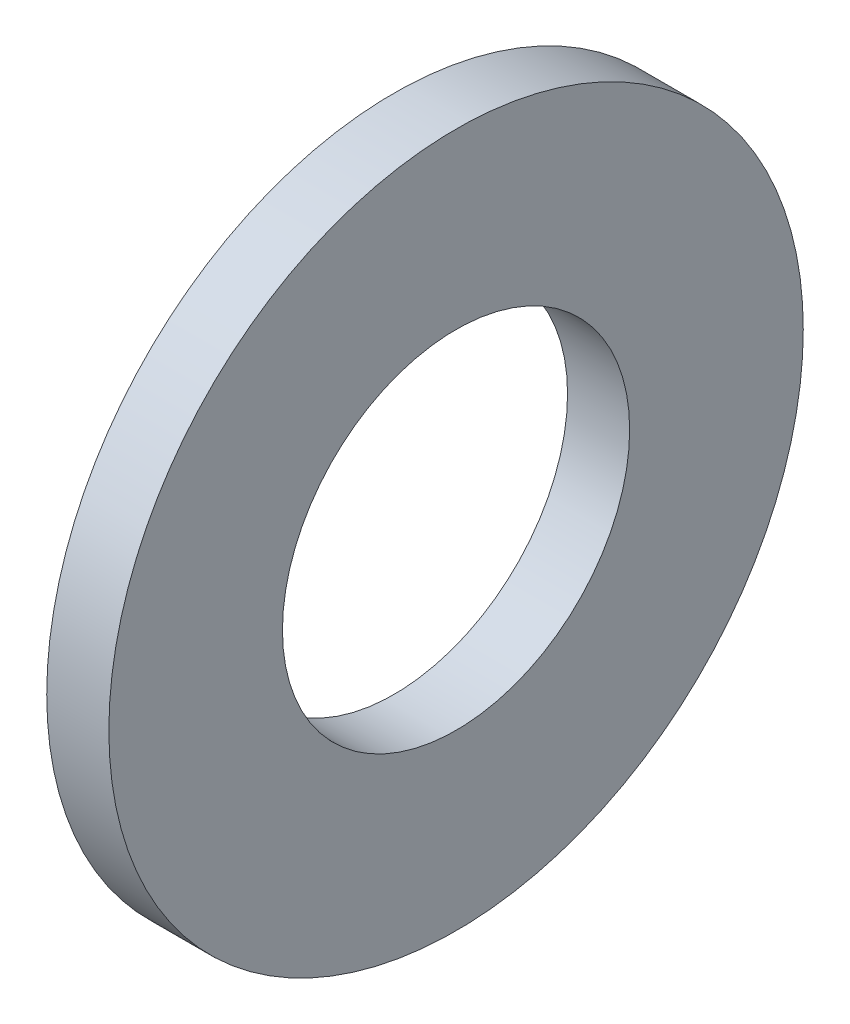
ISO-10303-21;
HEADER;
FILE_DESCRIPTION(('STEP AP214'),'2;1');
FILE_NAME('part.step','',(''),(''),'','','');
FILE_SCHEMA(('AUTOMOTIVE_DESIGN { 1 0 10303 214 1 1 1 1 }'));
ENDSEC;
DATA;
#1=APPLICATION_CONTEXT('core data for automotive mechanical design processes');
#2=APPLICATION_PROTOCOL_DEFINITION('international standard','automotive_design',2000,#1);
#3=PRODUCT_CONTEXT('',#1,'mechanical');
#4=PRODUCT('Part','Part','',(#3));
#5=PRODUCT_RELATED_PRODUCT_CATEGORY('part','',(#4));
#6=PRODUCT_DEFINITION_FORMATION('','',#4);
#7=PRODUCT_DEFINITION_CONTEXT('part definition',#1,'design');
#8=PRODUCT_DEFINITION('design','',#6,#7);
#9=PRODUCT_DEFINITION_SHAPE('','',#8);
#10=(LENGTH_UNIT() NAMED_UNIT(*) SI_UNIT(.MILLI.,.METRE.));
#11=(NAMED_UNIT(*) PLANE_ANGLE_UNIT() SI_UNIT($,.RADIAN.));
#12=(NAMED_UNIT(*) SI_UNIT($,.STERADIAN.) SOLID_ANGLE_UNIT());
#13=UNCERTAINTY_MEASURE_WITH_UNIT(LENGTH_MEASURE(1.E-05),#10,'distance_accuracy_value','');
#14=(GEOMETRIC_REPRESENTATION_CONTEXT(3) GLOBAL_UNCERTAINTY_ASSIGNED_CONTEXT((#13)) GLOBAL_UNIT_ASSIGNED_CONTEXT((#10,
#11,#12)) REPRESENTATION_CONTEXT('',''));
#15=CARTESIAN_POINT('',(0.,0.,0.));
#16=DIRECTION('',(0.,0.,1.));
#17=DIRECTION('',(1.,0.,0.));
#18=AXIS2_PLACEMENT_3D('',#15,#16,#17);
#19=CARTESIAN_POINT('',(-34.9249999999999,0.,0.));
#20=DIRECTION('',(-1.,0.,0.));
#21=DIRECTION('',(0.,0.,1.));
#22=AXIS2_PLACEMENT_3D('',#19,#20,#21);
#23=CYLINDRICAL_SURFACE('',#22,6.7437);
#24=CARTESIAN_POINT('',(0.,0.,0.));
#25=DIRECTION('',(-1.,0.,0.));
#26=DIRECTION('',(0.,0.,1.));
#27=AXIS2_PLACEMENT_3D('',#24,#25,#26);
#28=CIRCLE('',#27,6.7437);
#29=CARTESIAN_POINT('',(0.,0.,6.7437));
#30=VERTEX_POINT('',#29);
#31=EDGE_CURVE('E10',#30,#30,#28,.T.);
#32=ORIENTED_EDGE('',*,*,#31,.F.);
#33=EDGE_LOOP('',(#32));
#34=FACE_BOUND('',#33,.T.);
#35=CARTESIAN_POINT('',(-2.413,0.,0.));
#36=DIRECTION('',(-1.,0.,0.));
#37=DIRECTION('',(0.,0.,1.));
#38=AXIS2_PLACEMENT_3D('',#35,#36,#37);
#39=CIRCLE('',#38,6.7437);
#40=CARTESIAN_POINT('',(-2.413,0.,6.7437));
#41=VERTEX_POINT('',#40);
#42=EDGE_CURVE('E44',#41,#41,#39,.T.);
#43=ORIENTED_EDGE('',*,*,#42,.T.);
#44=EDGE_LOOP('',(#43));
#45=FACE_BOUND('',#44,.T.);
#46=ADVANCED_FACE('F30',(#34,#45),#23,.F.);
#47=CARTESIAN_POINT('',(0.,6.7437,0.));
#48=DIRECTION('',(-1.,0.,0.));
#49=DIRECTION('',(0.,0.,1.));
#50=AXIS2_PLACEMENT_3D('',#47,#48,#49);
#51=PLANE('',#50);
#52=CARTESIAN_POINT('',(0.,0.,0.));
#53=DIRECTION('',(-1.,0.,0.));
#54=DIRECTION('',(0.,0.,1.));
#55=AXIS2_PLACEMENT_3D('',#52,#53,#54);
#56=CIRCLE('',#55,13.4874);
#57=CARTESIAN_POINT('',(0.,0.,13.4874));
#58=VERTEX_POINT('',#57);
#59=EDGE_CURVE('E36',#58,#58,#56,.T.);
#60=ORIENTED_EDGE('',*,*,#59,.F.);
#61=EDGE_LOOP('',(#60));
#62=FACE_BOUND('',#61,.T.);
#63=ORIENTED_EDGE('',*,*,#31,.T.);
#64=EDGE_LOOP('',(#63));
#65=FACE_BOUND('',#64,.T.);
#66=ADVANCED_FACE('F59',(#62,#65),#51,.F.);
#67=CARTESIAN_POINT('',(-34.9249999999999,0.,0.));
#68=DIRECTION('',(-1.,0.,0.));
#69=DIRECTION('',(0.,0.,1.));
#70=AXIS2_PLACEMENT_3D('',#67,#68,#69);
#71=CYLINDRICAL_SURFACE('',#70,13.4874);
#72=CARTESIAN_POINT('',(-2.413,0.,0.));
#73=DIRECTION('',(-1.,0.,0.));
#74=DIRECTION('',(0.,0.,1.));
#75=AXIS2_PLACEMENT_3D('',#72,#73,#74);
#76=CIRCLE('',#75,13.4874);
#77=CARTESIAN_POINT('',(-2.413,0.,13.4874));
#78=VERTEX_POINT('',#77);
#79=EDGE_CURVE('E40',#78,#78,#76,.T.);
#80=ORIENTED_EDGE('',*,*,#79,.F.);
#81=EDGE_LOOP('',(#80));
#82=FACE_BOUND('',#81,.T.);
#83=ORIENTED_EDGE('',*,*,#59,.T.);
#84=EDGE_LOOP('',(#83));
#85=FACE_BOUND('',#84,.T.);
#86=ADVANCED_FACE('F54',(#82,#85),#71,.T.);
#87=CARTESIAN_POINT('',(-2.413,13.4874,0.));
#88=DIRECTION('',(1.,0.,0.));
#89=DIRECTION('',(0.,0.,-1.));
#90=AXIS2_PLACEMENT_3D('',#87,#88,#89);
#91=PLANE('',#90);
#92=ORIENTED_EDGE('',*,*,#42,.F.);
#93=EDGE_LOOP('',(#92));
#94=FACE_BOUND('',#93,.T.);
#95=ORIENTED_EDGE('',*,*,#79,.T.);
#96=EDGE_LOOP('',(#95));
#97=FACE_BOUND('',#96,.T.);
#98=ADVANCED_FACE('F51',(#94,#97),#91,.F.);
#99=CLOSED_SHELL('',(#46,#66,#86,#98));
#100=MANIFOLD_SOLID_BREP('B2',#99);
#101=ADVANCED_BREP_SHAPE_REPRESENTATION('',(#18,#100),#14);
#102=SHAPE_DEFINITION_REPRESENTATION(#9,#101);
ENDSEC;
END-ISO-10303-21;
